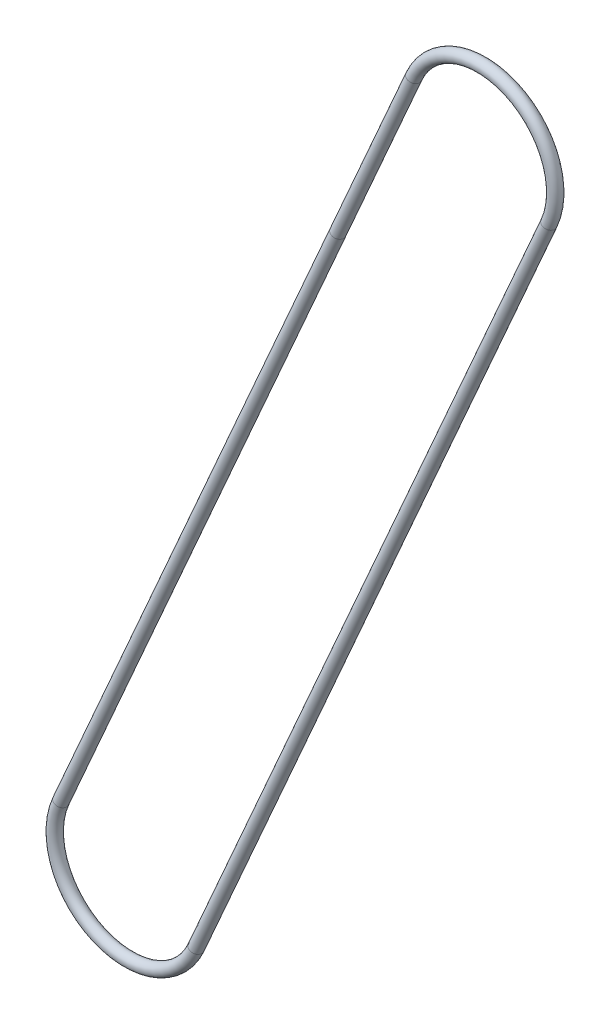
ISO-10303-21;
HEADER;
FILE_DESCRIPTION(('STEP AP214'),'2;1');
FILE_NAME('part.step','',(''),(''),'','','');
FILE_SCHEMA(('AUTOMOTIVE_DESIGN { 1 0 10303 214 1 1 1 1 }'));
ENDSEC;
DATA;
#1=APPLICATION_CONTEXT('core data for automotive mechanical design processes');
#2=APPLICATION_PROTOCOL_DEFINITION('international standard','automotive_design',2000,#1);
#3=PRODUCT_CONTEXT('',#1,'mechanical');
#4=PRODUCT('Part','Part','',(#3));
#5=PRODUCT_RELATED_PRODUCT_CATEGORY('part','',(#4));
#6=PRODUCT_DEFINITION_FORMATION('','',#4);
#7=PRODUCT_DEFINITION_CONTEXT('part definition',#1,'design');
#8=PRODUCT_DEFINITION('design','',#6,#7);
#9=PRODUCT_DEFINITION_SHAPE('','',#8);
#10=(LENGTH_UNIT() NAMED_UNIT(*) SI_UNIT(.MILLI.,.METRE.));
#11=(NAMED_UNIT(*) PLANE_ANGLE_UNIT() SI_UNIT($,.RADIAN.));
#12=(NAMED_UNIT(*) SI_UNIT($,.STERADIAN.) SOLID_ANGLE_UNIT());
#13=UNCERTAINTY_MEASURE_WITH_UNIT(LENGTH_MEASURE(1.E-05),#10,'distance_accuracy_value','');
#14=(GEOMETRIC_REPRESENTATION_CONTEXT(3) GLOBAL_UNCERTAINTY_ASSIGNED_CONTEXT((#13)) GLOBAL_UNIT_ASSIGNED_CONTEXT((#10,
#11,#12)) REPRESENTATION_CONTEXT('',''));
#15=CARTESIAN_POINT('',(0.,0.,0.));
#16=DIRECTION('',(0.,0.,1.));
#17=DIRECTION('',(1.,0.,0.));
#18=AXIS2_PLACEMENT_3D('',#15,#16,#17);
#19=CARTESIAN_POINT('',(-162.754417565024,-299.567364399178,0.));
#20=DIRECTION('',(0.402062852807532,0.915612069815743,0.));
#21=DIRECTION('',(-0.915612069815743,0.402062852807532,0.));
#22=AXIS2_PLACEMENT_3D('',#19,#20,#21);
#23=CYLINDRICAL_SURFACE('',#22,2.38125);
#24=CARTESIAN_POINT('',(-162.754417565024,-299.567364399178,0.));
#25=DIRECTION('',(-0.402062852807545,-0.915612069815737,0.));
#26=DIRECTION('',(0.915612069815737,-0.402062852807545,0.));
#27=AXIS2_PLACEMENT_3D('',#24,#25,#26);
#28=CIRCLE('',#27,2.38125);
#29=CARTESIAN_POINT('',(-164.934718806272,-298.60995223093,0.));
#30=VERTEX_POINT('',#29);
#31=EDGE_CURVE('E43',#30,#30,#28,.T.);
#32=ORIENTED_EDGE('',*,*,#31,.F.);
#33=EDGE_LOOP('',(#32));
#34=FACE_BOUND('',#33,.T.);
#35=CARTESIAN_POINT('',(-55.5242547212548,-55.373625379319,0.));
#36=DIRECTION('',(-0.402062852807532,-0.915612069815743,0.));
#37=DIRECTION('',(0.915612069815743,-0.402062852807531,0.));
#38=AXIS2_PLACEMENT_3D('',#35,#36,#37);
#39=CIRCLE('',#38,2.38125);
#40=CARTESIAN_POINT('',(-53.343953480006,-56.3310375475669,0.));
#41=VERTEX_POINT('',#40);
#42=EDGE_CURVE('E10',#41,#41,#39,.T.);
#43=ORIENTED_EDGE('',*,*,#42,.T.);
#44=EDGE_LOOP('',(#43));
#45=FACE_BOUND('',#44,.T.);
#46=ADVANCED_FACE('F33',(#34,#45),#23,.T.);
#47=CARTESIAN_POINT('',(-136.590802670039,-311.056310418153,0.));
#48=DIRECTION('',(0.,0.,-1.));
#49=DIRECTION('',(-1.,0.,0.));
#50=AXIS2_PLACEMENT_3D('',#47,#48,#49);
#51=TOROIDAL_SURFACE('',#50,28.575,2.38125);
#52=CARTESIAN_POINT('',(-110.427187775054,-322.545256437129,0.));
#53=DIRECTION('',(0.402062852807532,0.915612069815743,0.));
#54=DIRECTION('',(-0.915612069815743,0.402062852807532,0.));
#55=AXIS2_PLACEMENT_3D('',#52,#53,#54);
#56=CIRCLE('',#55,2.38125);
#57=CARTESIAN_POINT('',(-108.246886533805,-323.502668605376,0.));
#58=VERTEX_POINT('',#57);
#59=EDGE_CURVE('E48',#58,#58,#56,.T.);
#60=CARTESIAN_POINT('',(-136.590802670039,-311.056310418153,0.));
#61=DIRECTION('',(0.,0.,-1.));
#62=DIRECTION('',(-1.,0.,0.));
#63=AXIS2_PLACEMENT_3D('',#60,#61,#62);
#64=CIRCLE('',#63,30.95625);
#65=EDGE_CURVE('',#58,#30,#64,.T.);
#66=ORIENTED_EDGE('',*,*,#59,.F.);
#67=ORIENTED_EDGE('',*,*,#31,.T.);
#68=ORIENTED_EDGE('',*,*,#65,.T.);
#69=ORIENTED_EDGE('',*,*,#65,.F.);
#70=EDGE_LOOP('',(#66,#68,#67,#69));
#71=FACE_BOUND('',#70,.T.);
#72=ADVANCED_FACE('F78',(#71),#51,.T.);
#73=CARTESIAN_POINT('',(26.1636148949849,-11.4889460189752,0.));
#74=DIRECTION('',(-0.402062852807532,-0.915612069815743,0.));
#75=DIRECTION('',(0.915612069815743,-0.402062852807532,0.));
#76=AXIS2_PLACEMENT_3D('',#73,#74,#75);
#77=CYLINDRICAL_SURFACE('',#76,2.38125);
#78=CARTESIAN_POINT('',(26.1636148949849,-11.4889460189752,0.));
#79=DIRECTION('',(0.402062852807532,0.915612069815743,0.));
#80=DIRECTION('',(-0.915612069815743,0.402062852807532,0.));
#81=AXIS2_PLACEMENT_3D('',#78,#79,#80);
#82=CIRCLE('',#81,2.38125);
#83=CARTESIAN_POINT('',(28.3439161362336,-12.4463581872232,0.));
#84=VERTEX_POINT('',#83);
#85=EDGE_CURVE('E53',#84,#84,#82,.T.);
#86=ORIENTED_EDGE('',*,*,#85,.F.);
#87=EDGE_LOOP('',(#86));
#88=FACE_BOUND('',#87,.T.);
#89=ORIENTED_EDGE('',*,*,#59,.T.);
#90=EDGE_LOOP('',(#89));
#91=FACE_BOUND('',#90,.T.);
#92=ADVANCED_FACE('F72',(#88,#91),#77,.T.);
#93=CARTESIAN_POINT('',(0.,0.,0.));
#94=DIRECTION('',(0.,0.,-1.));
#95=DIRECTION('',(-1.,0.,0.));
#96=AXIS2_PLACEMENT_3D('',#93,#94,#95);
#97=TOROIDAL_SURFACE('',#96,28.575,2.38125);
#98=CARTESIAN_POINT('',(-26.1636148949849,11.4889460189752,0.));
#99=DIRECTION('',(-0.402062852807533,-0.915612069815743,0.));
#100=DIRECTION('',(0.915612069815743,-0.402062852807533,0.));
#101=AXIS2_PLACEMENT_3D('',#98,#99,#100);
#102=CIRCLE('',#101,2.38125);
#103=CARTESIAN_POINT('',(-28.3439161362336,12.4463581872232,0.));
#104=VERTEX_POINT('',#103);
#105=EDGE_CURVE('E96',#104,#104,#102,.T.);
#106=CARTESIAN_POINT('',(0.,0.,0.));
#107=DIRECTION('',(0.,0.,-1.));
#108=DIRECTION('',(-1.,0.,0.));
#109=AXIS2_PLACEMENT_3D('',#106,#107,#108);
#110=CIRCLE('',#109,30.95625);
#111=EDGE_CURVE('',#104,#84,#110,.T.);
#112=ORIENTED_EDGE('',*,*,#105,.F.);
#113=ORIENTED_EDGE('',*,*,#85,.T.);
#114=ORIENTED_EDGE('',*,*,#111,.T.);
#115=ORIENTED_EDGE('',*,*,#111,.F.);
#116=EDGE_LOOP('',(#112,#114,#113,#115));
#117=FACE_BOUND('',#116,.T.);
#118=ADVANCED_FACE('F67',(#117),#97,.T.);
#119=CARTESIAN_POINT('',(-26.1636148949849,11.4889460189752,0.));
#120=DIRECTION('',(-0.402062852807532,-0.915612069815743,0.));
#121=DIRECTION('',(0.915612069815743,-0.402062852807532,0.));
#122=AXIS2_PLACEMENT_3D('',#119,#120,#121);
#123=CYLINDRICAL_SURFACE('',#122,2.38125);
#124=ORIENTED_EDGE('',*,*,#105,.T.);
#125=EDGE_LOOP('',(#124));
#126=FACE_BOUND('',#125,.T.);
#127=ORIENTED_EDGE('',*,*,#42,.F.);
#128=EDGE_LOOP('',(#127));
#129=FACE_BOUND('',#128,.T.);
#130=ADVANCED_FACE('F65',(#126,#129),#123,.T.);
#131=CLOSED_SHELL('',(#46,#72,#92,#118,#130));
#132=MANIFOLD_SOLID_BREP('B2',#131);
#133=ADVANCED_BREP_SHAPE_REPRESENTATION('',(#18,#132),#14);
#134=SHAPE_DEFINITION_REPRESENTATION(#9,#133);
ENDSEC;
END-ISO-10303-21;
